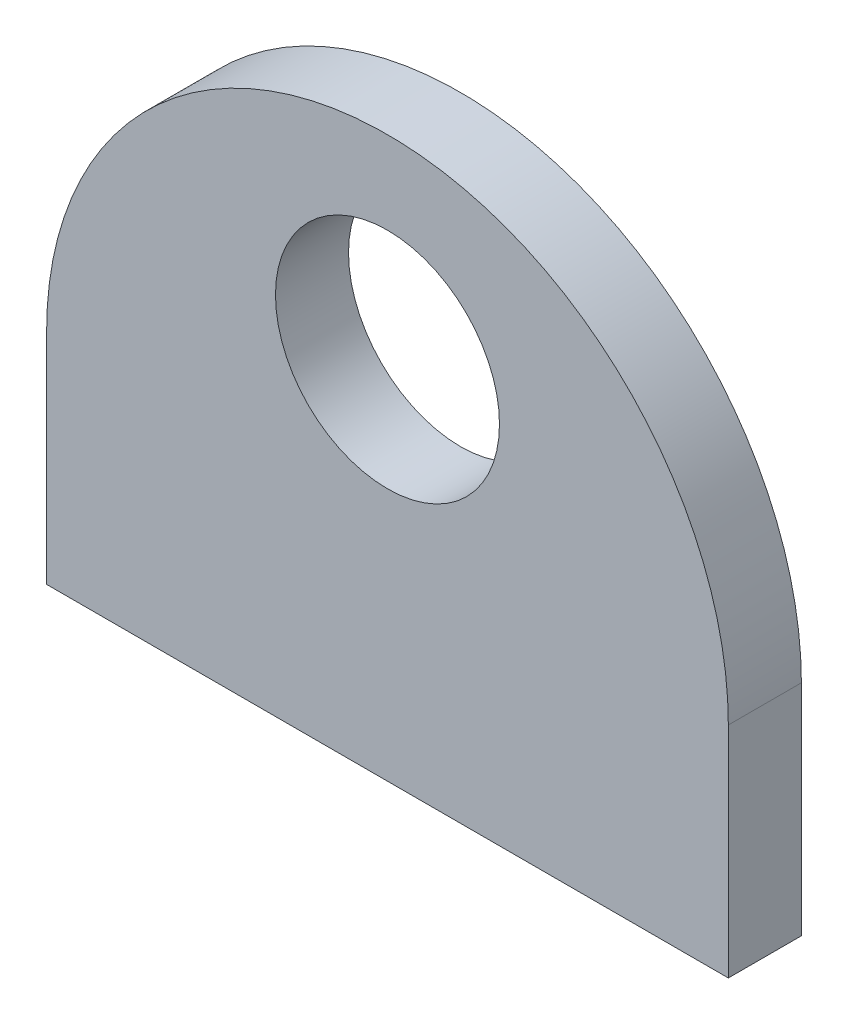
ISO-10303-21;
HEADER;
FILE_DESCRIPTION(('STEP AP214'),'2;1');
FILE_NAME('part.step','',(''),(''),'','','');
FILE_SCHEMA(('AUTOMOTIVE_DESIGN { 1 0 10303 214 1 1 1 1 }'));
ENDSEC;
DATA;
#1=APPLICATION_CONTEXT('core data for automotive mechanical design processes');
#2=APPLICATION_PROTOCOL_DEFINITION('international standard','automotive_design',2000,#1);
#3=PRODUCT_CONTEXT('',#1,'mechanical');
#4=PRODUCT('Part','Part','',(#3));
#5=PRODUCT_RELATED_PRODUCT_CATEGORY('part','',(#4));
#6=PRODUCT_DEFINITION_FORMATION('','',#4);
#7=PRODUCT_DEFINITION_CONTEXT('part definition',#1,'design');
#8=PRODUCT_DEFINITION('design','',#6,#7);
#9=PRODUCT_DEFINITION_SHAPE('','',#8);
#10=(LENGTH_UNIT() NAMED_UNIT(*) SI_UNIT(.MILLI.,.METRE.));
#11=(NAMED_UNIT(*) PLANE_ANGLE_UNIT() SI_UNIT($,.RADIAN.));
#12=(NAMED_UNIT(*) SI_UNIT($,.STERADIAN.) SOLID_ANGLE_UNIT());
#13=UNCERTAINTY_MEASURE_WITH_UNIT(LENGTH_MEASURE(1.E-05),#10,'distance_accuracy_value','');
#14=(GEOMETRIC_REPRESENTATION_CONTEXT(3) GLOBAL_UNCERTAINTY_ASSIGNED_CONTEXT((#13)) GLOBAL_UNIT_ASSIGNED_CONTEXT((#10,
#11,#12)) REPRESENTATION_CONTEXT('',''));
#15=CARTESIAN_POINT('',(0.,0.,0.));
#16=DIRECTION('',(0.,0.,1.));
#17=DIRECTION('',(1.,0.,0.));
#18=AXIS2_PLACEMENT_3D('',#15,#16,#17);
#19=CARTESIAN_POINT('',(0.,-6.,0.));
#20=DIRECTION('',(0.,0.,1.));
#21=DIRECTION('',(1.,0.,0.));
#22=AXIS2_PLACEMENT_3D('',#19,#20,#21);
#23=PLANE('',#22);
#24=DIRECTION('',(0.,1.,0.));
#25=VECTOR('',#24,1.);
#26=CARTESIAN_POINT('',(-14.,-15.,0.));
#27=LINE('',#26,#25);
#28=CARTESIAN_POINT('',(-14.,-15.,0.));
#29=VERTEX_POINT('',#28);
#30=CARTESIAN_POINT('',(-14.,-6.,0.));
#31=VERTEX_POINT('',#30);
#32=EDGE_CURVE('E73',#29,#31,#27,.T.);
#33=ORIENTED_EDGE('',*,*,#32,.T.);
#34=CARTESIAN_POINT('',(0.,-6.,0.));
#35=DIRECTION('',(0.,0.,1.));
#36=DIRECTION('',(1.,0.,0.));
#37=AXIS2_PLACEMENT_3D('',#34,#35,#36);
#38=CIRCLE('',#37,14.);
#39=CARTESIAN_POINT('',(14.,-6.,0.));
#40=VERTEX_POINT('',#39);
#41=EDGE_CURVE('E79',#40,#31,#38,.T.);
#42=ORIENTED_EDGE('',*,*,#41,.F.);
#43=DIRECTION('',(0.,-1.,0.));
#44=VECTOR('',#43,1.);
#45=CARTESIAN_POINT('',(14.,-6.,0.));
#46=LINE('',#45,#44);
#47=CARTESIAN_POINT('',(14.,-15.,0.));
#48=VERTEX_POINT('',#47);
#49=EDGE_CURVE('E84',#40,#48,#46,.T.);
#50=ORIENTED_EDGE('',*,*,#49,.T.);
#51=DIRECTION('',(1.,0.,0.));
#52=VECTOR('',#51,1.);
#53=CARTESIAN_POINT('',(-14.,-15.,0.));
#54=LINE('',#53,#52);
#55=EDGE_CURVE('E89',#29,#48,#54,.T.);
#56=ORIENTED_EDGE('',*,*,#55,.F.);
#57=EDGE_LOOP('',(#33,#42,#50,#56));
#58=FACE_BOUND('',#57,.T.);
#59=CARTESIAN_POINT('',(0.,0.,0.));
#60=DIRECTION('',(0.,0.,1.));
#61=DIRECTION('',(1.,0.,0.));
#62=AXIS2_PLACEMENT_3D('',#59,#60,#61);
#63=CIRCLE('',#62,4.6);
#64=CARTESIAN_POINT('',(4.6,0.,0.));
#65=VERTEX_POINT('',#64);
#66=EDGE_CURVE('E93',#65,#65,#63,.T.);
#67=ORIENTED_EDGE('',*,*,#66,.T.);
#68=EDGE_LOOP('',(#67));
#69=FACE_BOUND('',#68,.T.);
#70=ADVANCED_FACE('F30',(#58,#69),#23,.F.);
#71=CARTESIAN_POINT('',(0.,-6.,3.));
#72=DIRECTION('',(0.,0.,1.));
#73=DIRECTION('',(1.,0.,0.));
#74=AXIS2_PLACEMENT_3D('',#71,#72,#73);
#75=PLANE('',#74);
#76=DIRECTION('',(0.,1.,0.));
#77=VECTOR('',#76,1.);
#78=CARTESIAN_POINT('',(-14.,-15.,3.));
#79=LINE('',#78,#77);
#80=CARTESIAN_POINT('',(-14.,-15.,3.));
#81=VERTEX_POINT('',#80);
#82=CARTESIAN_POINT('',(-14.,-6.,3.));
#83=VERTEX_POINT('',#82);
#84=EDGE_CURVE('E74',#81,#83,#79,.T.);
#85=ORIENTED_EDGE('',*,*,#84,.F.);
#86=DIRECTION('',(1.,0.,0.));
#87=VECTOR('',#86,1.);
#88=CARTESIAN_POINT('',(-14.,-15.,3.));
#89=LINE('',#88,#87);
#90=CARTESIAN_POINT('',(14.,-15.,3.));
#91=VERTEX_POINT('',#90);
#92=EDGE_CURVE('E52',#81,#91,#89,.T.);
#93=ORIENTED_EDGE('',*,*,#92,.T.);
#94=DIRECTION('',(0.,-1.,0.));
#95=VECTOR('',#94,1.);
#96=CARTESIAN_POINT('',(14.,-6.,3.));
#97=LINE('',#96,#95);
#98=CARTESIAN_POINT('',(14.,-6.,3.));
#99=VERTEX_POINT('',#98);
#100=EDGE_CURVE('E102',#99,#91,#97,.T.);
#101=ORIENTED_EDGE('',*,*,#100,.F.);
#102=CARTESIAN_POINT('',(0.,-6.,3.));
#103=DIRECTION('',(0.,0.,1.));
#104=DIRECTION('',(1.,0.,0.));
#105=AXIS2_PLACEMENT_3D('',#102,#103,#104);
#106=CIRCLE('',#105,14.);
#107=EDGE_CURVE('E100',#99,#83,#106,.T.);
#108=ORIENTED_EDGE('',*,*,#107,.T.);
#109=EDGE_LOOP('',(#85,#93,#101,#108));
#110=FACE_BOUND('',#109,.T.);
#111=CARTESIAN_POINT('',(0.,0.,3.));
#112=DIRECTION('',(0.,0.,1.));
#113=DIRECTION('',(1.,0.,0.));
#114=AXIS2_PLACEMENT_3D('',#111,#112,#113);
#115=CIRCLE('',#114,4.6);
#116=CARTESIAN_POINT('',(4.6,0.,3.));
#117=VERTEX_POINT('',#116);
#118=EDGE_CURVE('E90',#117,#117,#115,.T.);
#119=ORIENTED_EDGE('',*,*,#118,.F.);
#120=EDGE_LOOP('',(#119));
#121=FACE_BOUND('',#120,.T.);
#122=ADVANCED_FACE('F110',(#110,#121),#75,.T.);
#123=CARTESIAN_POINT('',(-14.,-15.,3.));
#124=DIRECTION('',(-1.,0.,0.));
#125=DIRECTION('',(0.,0.,1.));
#126=AXIS2_PLACEMENT_3D('',#123,#124,#125);
#127=PLANE('',#126);
#128=ORIENTED_EDGE('',*,*,#32,.F.);
#129=DIRECTION('',(0.,0.,-1.));
#130=VECTOR('',#129,1.);
#131=CARTESIAN_POINT('',(-14.,-15.,3.));
#132=LINE('',#131,#130);
#133=EDGE_CURVE('E11',#81,#29,#132,.T.);
#134=ORIENTED_EDGE('',*,*,#133,.F.);
#135=ORIENTED_EDGE('',*,*,#84,.T.);
#136=DIRECTION('',(0.,0.,-1.));
#137=VECTOR('',#136,1.);
#138=CARTESIAN_POINT('',(-14.,-6.,3.));
#139=LINE('',#138,#137);
#140=EDGE_CURVE('E34',#83,#31,#139,.T.);
#141=ORIENTED_EDGE('',*,*,#140,.T.);
#142=EDGE_LOOP('',(#128,#134,#135,#141));
#143=FACE_BOUND('',#142,.T.);
#144=ADVANCED_FACE('F32',(#143),#127,.T.);
#145=CARTESIAN_POINT('',(-14.,-15.,3.));
#146=DIRECTION('',(0.,1.,0.));
#147=DIRECTION('',(-1.,0.,0.));
#148=AXIS2_PLACEMENT_3D('',#145,#146,#147);
#149=PLANE('',#148);
#150=ORIENTED_EDGE('',*,*,#55,.T.);
#151=DIRECTION('',(0.,0.,-1.));
#152=VECTOR('',#151,1.);
#153=CARTESIAN_POINT('',(14.,-15.,3.));
#154=LINE('',#153,#152);
#155=EDGE_CURVE('E39',#91,#48,#154,.T.);
#156=ORIENTED_EDGE('',*,*,#155,.F.);
#157=ORIENTED_EDGE('',*,*,#92,.F.);
#158=ORIENTED_EDGE('',*,*,#133,.T.);
#159=EDGE_LOOP('',(#150,#156,#157,#158));
#160=FACE_BOUND('',#159,.T.);
#161=ADVANCED_FACE('F109',(#160),#149,.F.);
#162=CARTESIAN_POINT('',(14.,-6.,3.));
#163=DIRECTION('',(1.,0.,0.));
#164=DIRECTION('',(0.,0.,-1.));
#165=AXIS2_PLACEMENT_3D('',#162,#163,#164);
#166=PLANE('',#165);
#167=ORIENTED_EDGE('',*,*,#49,.F.);
#168=DIRECTION('',(0.,0.,-1.));
#169=VECTOR('',#168,1.);
#170=CARTESIAN_POINT('',(14.,-6.,3.));
#171=LINE('',#170,#169);
#172=EDGE_CURVE('E77',#99,#40,#171,.T.);
#173=ORIENTED_EDGE('',*,*,#172,.F.);
#174=ORIENTED_EDGE('',*,*,#100,.T.);
#175=ORIENTED_EDGE('',*,*,#155,.T.);
#176=EDGE_LOOP('',(#167,#173,#174,#175));
#177=FACE_BOUND('',#176,.T.);
#178=ADVANCED_FACE('F107',(#177),#166,.T.);
#179=CARTESIAN_POINT('',(0.,-6.,3.));
#180=DIRECTION('',(0.,0.,-1.));
#181=DIRECTION('',(-1.,0.,0.));
#182=AXIS2_PLACEMENT_3D('',#179,#180,#181);
#183=CYLINDRICAL_SURFACE('',#182,14.);
#184=ORIENTED_EDGE('',*,*,#41,.T.);
#185=ORIENTED_EDGE('',*,*,#140,.F.);
#186=ORIENTED_EDGE('',*,*,#107,.F.);
#187=ORIENTED_EDGE('',*,*,#172,.T.);
#188=EDGE_LOOP('',(#184,#185,#186,#187));
#189=FACE_BOUND('',#188,.T.);
#190=ADVANCED_FACE('F80',(#189),#183,.T.);
#191=CARTESIAN_POINT('',(0.,0.,3.));
#192=DIRECTION('',(0.,0.,-1.));
#193=DIRECTION('',(-1.,0.,0.));
#194=AXIS2_PLACEMENT_3D('',#191,#192,#193);
#195=CYLINDRICAL_SURFACE('',#194,4.6);
#196=ORIENTED_EDGE('',*,*,#118,.T.);
#197=EDGE_LOOP('',(#196));
#198=FACE_BOUND('',#197,.T.);
#199=ORIENTED_EDGE('',*,*,#66,.F.);
#200=EDGE_LOOP('',(#199));
#201=FACE_BOUND('',#200,.T.);
#202=ADVANCED_FACE('F116',(#198,#201),#195,.F.);
#203=CLOSED_SHELL('',(#70,#122,#144,#161,#178,#190,#202));
#204=MANIFOLD_SOLID_BREP('B2',#203);
#205=ADVANCED_BREP_SHAPE_REPRESENTATION('',(#18,#204),#14);
#206=SHAPE_DEFINITION_REPRESENTATION(#9,#205);
ENDSEC;
END-ISO-10303-21;
